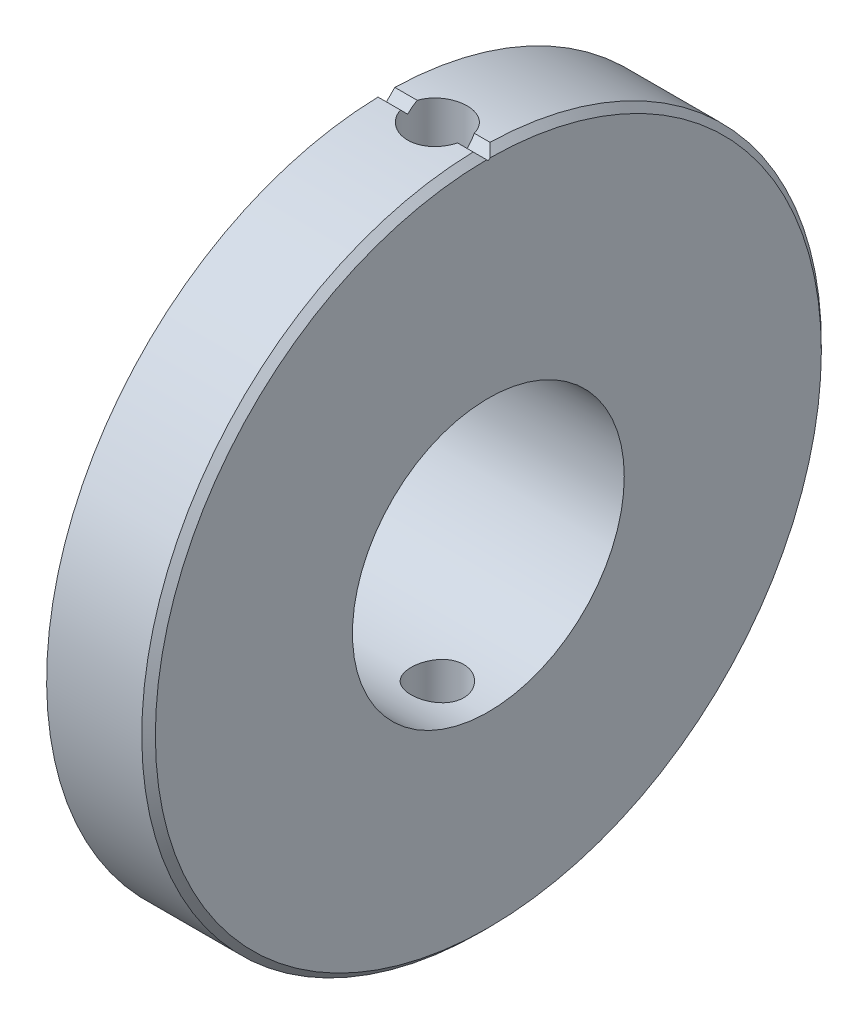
from build123d import *

# Parameters (mm, degrees)
CHANFREIN1_SIZE              = 0.4
ESQUISSE2_R                  = 8
ENL_V_MAT_EXTRU_1_DEPTH      = 31.923292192
ENL_V_MAT_EXTRU_2_DEPTH      = 31.923292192
ENL_V_MAT_EXTRU_2_DEPTH_BACK = 31.923292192
ESQUISSE3_R                  = 1.55
ENL_V_MAT_EXTRU_3_DEPTH      = 31.923292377
ESQUISSE9_R                  = 1.75
ENL_V_MAT_EXTRU_4_DEPTH      = 10


with BuildPart() as part:
    # Esquisse1 → Base-R_volution (revolve)
    with BuildSketch(Plane.XY, mode=Mode.PRIVATE) as base_r_volution_sk:
        Polygon((0, 0), (0, 10), (6.5, 10), (6.5, 20), (12.5, 20), (12.5, 0), align=None)
    revolve(base_r_volution_sk.sketch.rotate(Axis((0, 0, 0), (1, 0, 0)), 90), axis=Axis((0, 0, 0), (1, 0, 0)))

    # Chanfrein1
    chanfrein1_edges = [part.edges().sort_by_distance(p)[0] for p in [
        (12.5, 0, -20),
        (0, 0, -10),
    ]]
    chamfer(chanfrein1_edges, length=CHANFREIN1_SIZE)

    # Esquisse2 → Enl_v. mat.-Extru.1 (cut, through all)
    with BuildSketch(Plane(origin=(12.5, 0, 0), x_dir=(0, 0, -1), z_dir=(1, 0, 0))):
        with Locations((0, -0.6)):
            Circle(ESQUISSE2_R)
    extrude(amount=-ENL_V_MAT_EXTRU_1_DEPTH, mode=Mode.SUBTRACT)

    # Esquisse3 → Enl_v. mat.-Extru.2 (cut, two sides: drawn at the far end of the back side and taken through both)
    with BuildSketch(Plane(origin=(0, 0, 0), x_dir=(1, 0, 0), z_dir=(0, 1, 0)).offset(-ENL_V_MAT_EXTRU_2_DEPTH_BACK)):
        with Locations(Location((9.5, 0, 0), (0, 0, 270))):
            Circle(ESQUISSE3_R)
    extrude(amount=ENL_V_MAT_EXTRU_2_DEPTH + ENL_V_MAT_EXTRU_2_DEPTH_BACK, mode=Mode.SUBTRACT)

    # Esquisse6 → Enl_v. mat.-Extru.3 (cut, through all)
    with BuildSketch(Plane(origin=(12.5, 0, 0), x_dir=(0, 0, -1), z_dir=(1, 0, 0))):
        Polygon((0, 19.5), (-3, 22.5), (3, 22.5), align=None)
    extrude(amount=-ENL_V_MAT_EXTRU_3_DEPTH, mode=Mode.SUBTRACT)

    # Esquisse9 → Enl_v. mat.-Extru.4 (cut)
    with BuildSketch(Plane(origin=(0, 10, 0), x_dir=(-1, 0, 0), z_dir=(0, 1, 0))):
        with Locations(Location((-9.5, 0, 0), (0, 0, 196.393279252))):
            Circle(ESQUISSE9_R)
    extrude(amount=ENL_V_MAT_EXTRU_4_DEPTH, mode=Mode.SUBTRACT)


solid = part.part
